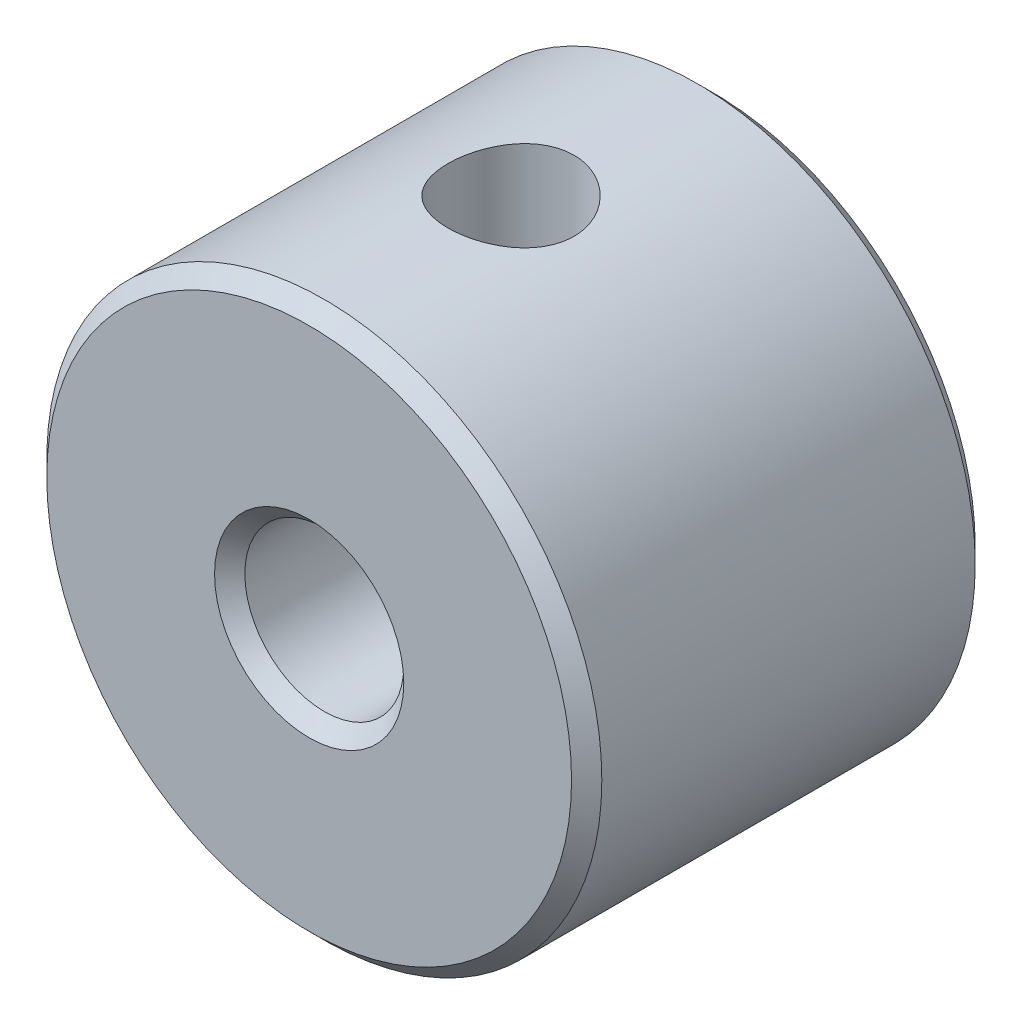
from build123d import *

# Parameters (mm, degrees)
ESQUISSE1_R             = 5.5
ESQUISSE1_R_2           = 1.575
BOSS_EXTRU_1_DEPTH      = 8
ESQUISSE2_R             = 1.25
ENL_V_MAT_EXTRU_1_DEPTH = 8
CHANFREIN1_SIZE         = 0.3


with BuildPart() as part:
    # Esquisse1 → Boss.-Extru.1 (new body)
    with BuildSketch(Plane.XY):
        Circle(ESQUISSE1_R)
        Circle(ESQUISSE1_R_2, mode=Mode.SUBTRACT)
    extrude(amount=BOSS_EXTRU_1_DEPTH)

    # Esquisse2 → Enl_v. mat.-Extru.1 (cut)
    with BuildSketch(Plane(origin=(0, 0, 0), x_dir=(-1, 0, 0), z_dir=(0, 1, 0))):
        with Locations(Location((0, 4, 0), (0, 0, 270))):
            Circle(ESQUISSE2_R)
    extrude(amount=ENL_V_MAT_EXTRU_1_DEPTH, mode=Mode.SUBTRACT)

    # Chanfrein1
    chanfrein1_edges = [part.edges().sort_by_distance(p)[0] for p in [
        (-5.5, 0, 0),
        (-5.5, 0, 8),
        (-1.575, 0, 0),
        (-1.575, 0, 8),
    ]]
    chamfer(chanfrein1_edges, length=CHANFREIN1_SIZE)


solid = part.part
